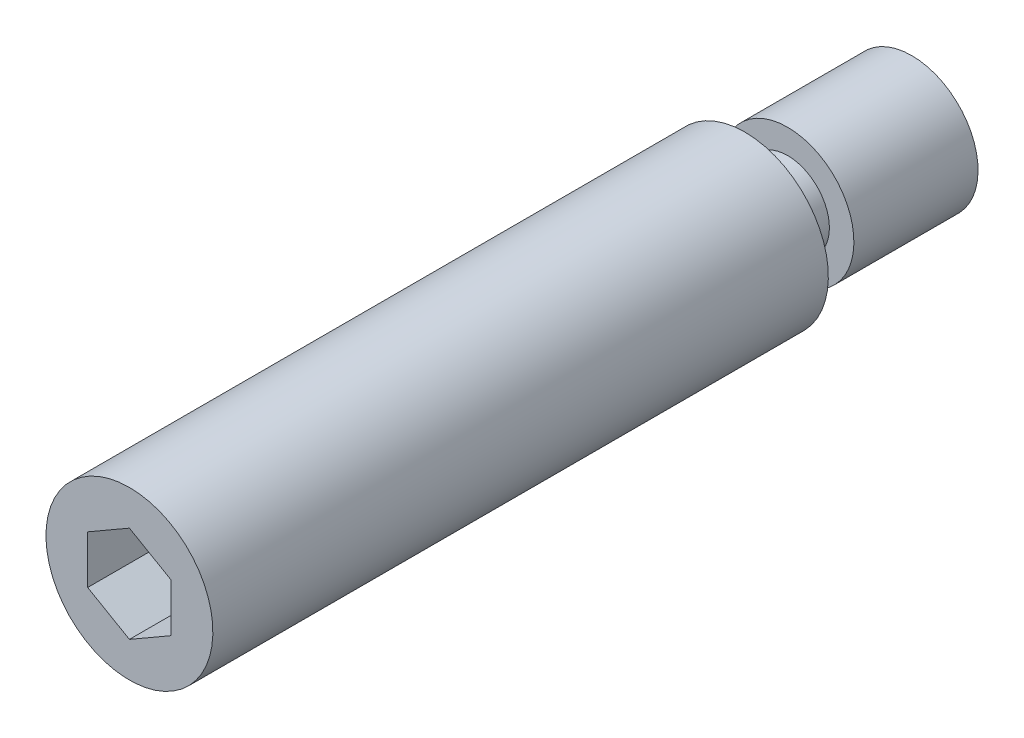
ISO-10303-21;
HEADER;
FILE_DESCRIPTION(('STEP AP214'),'2;1');
FILE_NAME('part.step','',(''),(''),'','','');
FILE_SCHEMA(('AUTOMOTIVE_DESIGN { 1 0 10303 214 1 1 1 1 }'));
ENDSEC;
DATA;
#1=APPLICATION_CONTEXT('core data for automotive mechanical design processes');
#2=APPLICATION_PROTOCOL_DEFINITION('international standard','automotive_design',2000,#1);
#3=PRODUCT_CONTEXT('',#1,'mechanical');
#4=PRODUCT('Part','Part','',(#3));
#5=PRODUCT_RELATED_PRODUCT_CATEGORY('part','',(#4));
#6=PRODUCT_DEFINITION_FORMATION('','',#4);
#7=PRODUCT_DEFINITION_CONTEXT('part definition',#1,'design');
#8=PRODUCT_DEFINITION('design','',#6,#7);
#9=PRODUCT_DEFINITION_SHAPE('','',#8);
#10=(LENGTH_UNIT() NAMED_UNIT(*) SI_UNIT(.MILLI.,.METRE.));
#11=(NAMED_UNIT(*) PLANE_ANGLE_UNIT() SI_UNIT($,.RADIAN.));
#12=(NAMED_UNIT(*) SI_UNIT($,.STERADIAN.) SOLID_ANGLE_UNIT());
#13=UNCERTAINTY_MEASURE_WITH_UNIT(LENGTH_MEASURE(1.E-05),#10,'distance_accuracy_value','');
#14=(GEOMETRIC_REPRESENTATION_CONTEXT(3) GLOBAL_UNCERTAINTY_ASSIGNED_CONTEXT((#13)) GLOBAL_UNIT_ASSIGNED_CONTEXT((#10,
#11,#12)) REPRESENTATION_CONTEXT('',''));
#15=CARTESIAN_POINT('',(0.,0.,0.));
#16=DIRECTION('',(0.,0.,1.));
#17=DIRECTION('',(1.,0.,0.));
#18=AXIS2_PLACEMENT_3D('',#15,#16,#17);
#19=CARTESIAN_POINT('',(0.,-8.,16.));
#20=DIRECTION('',(0.,0.,-1.));
#21=DIRECTION('',(0.,-1.,0.));
#22=AXIS2_PLACEMENT_3D('',#19,#20,#21);
#23=PLANE('',#22);
#24=CARTESIAN_POINT('',(0.,0.,16.));
#25=DIRECTION('',(0.,0.,1.));
#26=DIRECTION('',(0.,1.,0.));
#27=AXIS2_PLACEMENT_3D('',#24,#25,#26);
#28=CIRCLE('',#27,4.);
#29=CARTESIAN_POINT('',(0.,4.,16.));
#30=VERTEX_POINT('',#29);
#31=EDGE_CURVE('E115',#30,#30,#28,.T.);
#32=ORIENTED_EDGE('',*,*,#31,.T.);
#33=EDGE_LOOP('',(#32));
#34=FACE_BOUND('',#33,.T.);
#35=CARTESIAN_POINT('',(0.,0.,16.));
#36=DIRECTION('',(0.,0.,1.));
#37=DIRECTION('',(0.,1.,0.));
#38=AXIS2_PLACEMENT_3D('',#35,#36,#37);
#39=CIRCLE('',#38,8.);
#40=CARTESIAN_POINT('',(0.,8.,16.));
#41=VERTEX_POINT('',#40);
#42=EDGE_CURVE('E9',#41,#41,#39,.T.);
#43=ORIENTED_EDGE('',*,*,#42,.F.);
#44=EDGE_LOOP('',(#43));
#45=FACE_BOUND('',#44,.T.);
#46=ADVANCED_FACE('F14',(#34,#45),#23,.T.);
#47=CARTESIAN_POINT('',(0.,0.,20.));
#48=DIRECTION('',(0.,0.,1.));
#49=DIRECTION('',(0.,1.,0.));
#50=AXIS2_PLACEMENT_3D('',#47,#48,#49);
#51=CYLINDRICAL_SURFACE('',#50,8.);
#52=CARTESIAN_POINT('',(0.,0.,75.));
#53=DIRECTION('',(0.,0.,1.));
#54=DIRECTION('',(0.,1.,0.));
#55=AXIS2_PLACEMENT_3D('',#52,#53,#54);
#56=CIRCLE('',#55,8.);
#57=CARTESIAN_POINT('',(0.,8.,75.));
#58=VERTEX_POINT('',#57);
#59=EDGE_CURVE('E21',#58,#58,#56,.T.);
#60=ORIENTED_EDGE('',*,*,#59,.F.);
#61=EDGE_LOOP('',(#60));
#62=FACE_BOUND('',#61,.T.);
#63=ORIENTED_EDGE('',*,*,#42,.T.);
#64=EDGE_LOOP('',(#63));
#65=FACE_BOUND('',#64,.T.);
#66=ADVANCED_FACE('F136',(#62,#65),#51,.T.);
#67=CARTESIAN_POINT('',(0.,-8.,75.));
#68=DIRECTION('',(0.,0.,-1.));
#69=DIRECTION('',(0.,-1.,0.));
#70=AXIS2_PLACEMENT_3D('',#67,#68,#69);
#71=PLANE('',#70);
#72=DIRECTION('',(-0.866025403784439,-0.5,0.));
#73=VECTOR('',#72,1.);
#74=CARTESIAN_POINT('',(0.,4.61880215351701,75.));
#75=LINE('',#74,#73);
#76=CARTESIAN_POINT('',(0.,4.61880215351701,75.));
#77=VERTEX_POINT('',#76);
#78=CARTESIAN_POINT('',(-4.,2.30940107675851,75.));
#79=VERTEX_POINT('',#78);
#80=EDGE_CURVE('E102',#77,#79,#75,.T.);
#81=ORIENTED_EDGE('',*,*,#80,.F.);
#82=DIRECTION('',(-0.866025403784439,0.5,0.));
#83=VECTOR('',#82,1.);
#84=CARTESIAN_POINT('',(4.,2.30940107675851,75.));
#85=LINE('',#84,#83);
#86=CARTESIAN_POINT('',(4.,2.30940107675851,75.));
#87=VERTEX_POINT('',#86);
#88=EDGE_CURVE('E28',#87,#77,#85,.T.);
#89=ORIENTED_EDGE('',*,*,#88,.F.);
#90=DIRECTION('',(0.,1.,0.));
#91=VECTOR('',#90,1.);
#92=CARTESIAN_POINT('',(4.,-2.30940107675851,75.));
#93=LINE('',#92,#91);
#94=CARTESIAN_POINT('',(4.,-2.30940107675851,75.));
#95=VERTEX_POINT('',#94);
#96=EDGE_CURVE('E111',#95,#87,#93,.T.);
#97=ORIENTED_EDGE('',*,*,#96,.F.);
#98=DIRECTION('',(0.866025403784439,0.5,0.));
#99=VECTOR('',#98,1.);
#100=CARTESIAN_POINT('',(0.,-4.61880215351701,75.));
#101=LINE('',#100,#99);
#102=CARTESIAN_POINT('',(0.,-4.61880215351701,75.));
#103=VERTEX_POINT('',#102);
#104=EDGE_CURVE('E109',#103,#95,#101,.T.);
#105=ORIENTED_EDGE('',*,*,#104,.F.);
#106=DIRECTION('',(0.866025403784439,-0.5,0.));
#107=VECTOR('',#106,1.);
#108=CARTESIAN_POINT('',(-4.,-2.30940107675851,75.));
#109=LINE('',#108,#107);
#110=CARTESIAN_POINT('',(-4.,-2.30940107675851,75.));
#111=VERTEX_POINT('',#110);
#112=EDGE_CURVE('E76',#111,#103,#109,.T.);
#113=ORIENTED_EDGE('',*,*,#112,.F.);
#114=DIRECTION('',(0.,-1.,0.));
#115=VECTOR('',#114,1.);
#116=CARTESIAN_POINT('',(-4.,2.30940107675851,75.));
#117=LINE('',#116,#115);
#118=EDGE_CURVE('E105',#79,#111,#117,.T.);
#119=ORIENTED_EDGE('',*,*,#118,.F.);
#120=EDGE_LOOP('',(#81,#89,#97,#105,#113,#119));
#121=FACE_BOUND('',#120,.T.);
#122=ORIENTED_EDGE('',*,*,#59,.T.);
#123=EDGE_LOOP('',(#122));
#124=FACE_BOUND('',#123,.T.);
#125=ADVANCED_FACE('F134',(#121,#124),#71,.F.);
#126=CARTESIAN_POINT('',(0.,-6.35,0.));
#127=DIRECTION('',(0.,0.,-1.));
#128=DIRECTION('',(0.,-1.,0.));
#129=AXIS2_PLACEMENT_3D('',#126,#127,#128);
#130=PLANE('',#129);
#131=CARTESIAN_POINT('',(0.,0.,0.));
#132=DIRECTION('',(0.,0.,1.));
#133=DIRECTION('',(0.,1.,0.));
#134=AXIS2_PLACEMENT_3D('',#131,#132,#133);
#135=CIRCLE('',#134,6.35);
#136=CARTESIAN_POINT('',(0.,6.35,0.));
#137=VERTEX_POINT('',#136);
#138=EDGE_CURVE('E129',#137,#137,#135,.T.);
#139=ORIENTED_EDGE('',*,*,#138,.F.);
#140=EDGE_LOOP('',(#139));
#141=FACE_BOUND('',#140,.T.);
#142=ADVANCED_FACE('F167',(#141),#130,.T.);
#143=CARTESIAN_POINT('',(0.,0.,20.));
#144=DIRECTION('',(0.,0.,1.));
#145=DIRECTION('',(0.,1.,0.));
#146=AXIS2_PLACEMENT_3D('',#143,#144,#145);
#147=CYLINDRICAL_SURFACE('',#146,6.35);
#148=ORIENTED_EDGE('',*,*,#138,.T.);
#149=EDGE_LOOP('',(#148));
#150=FACE_BOUND('',#149,.T.);
#151=CARTESIAN_POINT('',(0.,0.,11.9));
#152=DIRECTION('',(0.,0.,1.));
#153=DIRECTION('',(0.,1.,0.));
#154=AXIS2_PLACEMENT_3D('',#151,#152,#153);
#155=CIRCLE('',#154,6.35);
#156=CARTESIAN_POINT('',(0.,6.35,11.9));
#157=VERTEX_POINT('',#156);
#158=EDGE_CURVE('E126',#157,#157,#155,.T.);
#159=ORIENTED_EDGE('',*,*,#158,.F.);
#160=EDGE_LOOP('',(#159));
#161=FACE_BOUND('',#160,.T.);
#162=ADVANCED_FACE('F160',(#150,#161),#147,.T.);
#163=CARTESIAN_POINT('',(0.,-4.,11.9));
#164=DIRECTION('',(0.,0.,1.));
#165=DIRECTION('',(0.,1.,0.));
#166=AXIS2_PLACEMENT_3D('',#163,#164,#165);
#167=PLANE('',#166);
#168=ORIENTED_EDGE('',*,*,#158,.T.);
#169=EDGE_LOOP('',(#168));
#170=FACE_BOUND('',#169,.T.);
#171=CARTESIAN_POINT('',(0.,0.,11.9));
#172=DIRECTION('',(0.,0.,1.));
#173=DIRECTION('',(0.,1.,0.));
#174=AXIS2_PLACEMENT_3D('',#171,#172,#173);
#175=CIRCLE('',#174,4.);
#176=CARTESIAN_POINT('',(0.,4.,11.9));
#177=VERTEX_POINT('',#176);
#178=EDGE_CURVE('E123',#177,#177,#175,.T.);
#179=ORIENTED_EDGE('',*,*,#178,.F.);
#180=EDGE_LOOP('',(#179));
#181=FACE_BOUND('',#180,.T.);
#182=ADVANCED_FACE('F151',(#170,#181),#167,.T.);
#183=CARTESIAN_POINT('',(0.,0.,20.));
#184=DIRECTION('',(0.,0.,1.));
#185=DIRECTION('',(0.,1.,0.));
#186=AXIS2_PLACEMENT_3D('',#183,#184,#185);
#187=CYLINDRICAL_SURFACE('',#186,4.);
#188=ORIENTED_EDGE('',*,*,#178,.T.);
#189=EDGE_LOOP('',(#188));
#190=FACE_BOUND('',#189,.T.);
#191=ORIENTED_EDGE('',*,*,#31,.F.);
#192=EDGE_LOOP('',(#191));
#193=FACE_BOUND('',#192,.T.);
#194=ADVANCED_FACE('F148',(#190,#193),#187,.T.);
#195=CARTESIAN_POINT('',(4.,2.30940107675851,65.));
#196=DIRECTION('',(0.5,0.866025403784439,0.));
#197=DIRECTION('',(-0.866025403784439,0.5,0.));
#198=AXIS2_PLACEMENT_3D('',#195,#196,#197);
#199=PLANE('',#198);
#200=ORIENTED_EDGE('',*,*,#88,.T.);
#201=DIRECTION('',(0.,0.,1.));
#202=VECTOR('',#201,1.);
#203=CARTESIAN_POINT('',(0.,4.61880215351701,65.));
#204=LINE('',#203,#202);
#205=CARTESIAN_POINT('',(0.,4.61880215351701,65.));
#206=VERTEX_POINT('',#205);
#207=EDGE_CURVE('E58',#206,#77,#204,.T.);
#208=ORIENTED_EDGE('',*,*,#207,.F.);
#209=DIRECTION('',(-0.866025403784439,0.5,0.));
#210=VECTOR('',#209,1.);
#211=CARTESIAN_POINT('',(4.,2.30940107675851,65.));
#212=LINE('',#211,#210);
#213=CARTESIAN_POINT('',(4.,2.30940107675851,65.));
#214=VERTEX_POINT('',#213);
#215=EDGE_CURVE('E113',#214,#206,#212,.T.);
#216=ORIENTED_EDGE('',*,*,#215,.F.);
#217=DIRECTION('',(0.,0.,1.));
#218=VECTOR('',#217,1.);
#219=CARTESIAN_POINT('',(4.,2.30940107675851,65.));
#220=LINE('',#219,#218);
#221=EDGE_CURVE('E36',#214,#87,#220,.T.);
#222=ORIENTED_EDGE('',*,*,#221,.T.);
#223=EDGE_LOOP('',(#200,#208,#216,#222));
#224=FACE_BOUND('',#223,.T.);
#225=ADVANCED_FACE('F150',(#224),#199,.F.);
#226=CARTESIAN_POINT('',(4.,-2.30940107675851,65.));
#227=DIRECTION('',(1.,0.,0.));
#228=DIRECTION('',(0.,0.,-1.));
#229=AXIS2_PLACEMENT_3D('',#226,#227,#228);
#230=PLANE('',#229);
#231=ORIENTED_EDGE('',*,*,#96,.T.);
#232=ORIENTED_EDGE('',*,*,#221,.F.);
#233=DIRECTION('',(0.,1.,0.));
#234=VECTOR('',#233,1.);
#235=CARTESIAN_POINT('',(4.,-2.30940107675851,65.));
#236=LINE('',#235,#234);
#237=CARTESIAN_POINT('',(4.,-2.30940107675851,65.));
#238=VERTEX_POINT('',#237);
#239=EDGE_CURVE('E88',#238,#214,#236,.T.);
#240=ORIENTED_EDGE('',*,*,#239,.F.);
#241=DIRECTION('',(0.,0.,1.));
#242=VECTOR('',#241,1.);
#243=CARTESIAN_POINT('',(4.,-2.30940107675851,65.));
#244=LINE('',#243,#242);
#245=EDGE_CURVE('E80',#238,#95,#244,.T.);
#246=ORIENTED_EDGE('',*,*,#245,.T.);
#247=EDGE_LOOP('',(#231,#232,#240,#246));
#248=FACE_BOUND('',#247,.T.);
#249=ADVANCED_FACE('F158',(#248),#230,.F.);
#250=CARTESIAN_POINT('',(0.,-4.61880215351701,65.));
#251=DIRECTION('',(0.5,-0.866025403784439,0.));
#252=DIRECTION('',(0.866025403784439,0.5,0.));
#253=AXIS2_PLACEMENT_3D('',#250,#251,#252);
#254=PLANE('',#253);
#255=ORIENTED_EDGE('',*,*,#104,.T.);
#256=ORIENTED_EDGE('',*,*,#245,.F.);
#257=DIRECTION('',(0.866025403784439,0.5,0.));
#258=VECTOR('',#257,1.);
#259=CARTESIAN_POINT('',(0.,-4.61880215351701,65.));
#260=LINE('',#259,#258);
#261=CARTESIAN_POINT('',(0.,-4.61880215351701,65.));
#262=VERTEX_POINT('',#261);
#263=EDGE_CURVE('E84',#262,#238,#260,.T.);
#264=ORIENTED_EDGE('',*,*,#263,.F.);
#265=DIRECTION('',(0.,0.,1.));
#266=VECTOR('',#265,1.);
#267=CARTESIAN_POINT('',(0.,-4.61880215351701,65.));
#268=LINE('',#267,#266);
#269=EDGE_CURVE('E69',#262,#103,#268,.T.);
#270=ORIENTED_EDGE('',*,*,#269,.T.);
#271=EDGE_LOOP('',(#255,#256,#264,#270));
#272=FACE_BOUND('',#271,.T.);
#273=ADVANCED_FACE('F85',(#272),#254,.F.);
#274=CARTESIAN_POINT('',(-4.,-2.30940107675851,65.));
#275=DIRECTION('',(-0.5,-0.866025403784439,0.));
#276=DIRECTION('',(0.866025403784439,-0.5,0.));
#277=AXIS2_PLACEMENT_3D('',#274,#275,#276);
#278=PLANE('',#277);
#279=ORIENTED_EDGE('',*,*,#112,.T.);
#280=ORIENTED_EDGE('',*,*,#269,.F.);
#281=DIRECTION('',(0.866025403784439,-0.5,0.));
#282=VECTOR('',#281,1.);
#283=CARTESIAN_POINT('',(-4.,-2.30940107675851,65.));
#284=LINE('',#283,#282);
#285=CARTESIAN_POINT('',(-4.,-2.30940107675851,65.));
#286=VERTEX_POINT('',#285);
#287=EDGE_CURVE('E73',#286,#262,#284,.T.);
#288=ORIENTED_EDGE('',*,*,#287,.F.);
#289=DIRECTION('',(0.,0.,1.));
#290=VECTOR('',#289,1.);
#291=CARTESIAN_POINT('',(-4.,-2.30940107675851,65.));
#292=LINE('',#291,#290);
#293=EDGE_CURVE('E81',#286,#111,#292,.T.);
#294=ORIENTED_EDGE('',*,*,#293,.T.);
#295=EDGE_LOOP('',(#279,#280,#288,#294));
#296=FACE_BOUND('',#295,.T.);
#297=ADVANCED_FACE('F71',(#296),#278,.F.);
#298=CARTESIAN_POINT('',(-4.,2.30940107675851,65.));
#299=DIRECTION('',(-1.,0.,0.));
#300=DIRECTION('',(0.,-1.,0.));
#301=AXIS2_PLACEMENT_3D('',#298,#299,#300);
#302=PLANE('',#301);
#303=ORIENTED_EDGE('',*,*,#118,.T.);
#304=ORIENTED_EDGE('',*,*,#293,.F.);
#305=DIRECTION('',(0.,-1.,0.));
#306=VECTOR('',#305,1.);
#307=CARTESIAN_POINT('',(-4.,2.30940107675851,65.));
#308=LINE('',#307,#306);
#309=CARTESIAN_POINT('',(-4.,2.30940107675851,65.));
#310=VERTEX_POINT('',#309);
#311=EDGE_CURVE('E94',#310,#286,#308,.T.);
#312=ORIENTED_EDGE('',*,*,#311,.F.);
#313=DIRECTION('',(0.,0.,1.));
#314=VECTOR('',#313,1.);
#315=CARTESIAN_POINT('',(-4.,2.30940107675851,65.));
#316=LINE('',#315,#314);
#317=EDGE_CURVE('E118',#310,#79,#316,.T.);
#318=ORIENTED_EDGE('',*,*,#317,.T.);
#319=EDGE_LOOP('',(#303,#304,#312,#318));
#320=FACE_BOUND('',#319,.T.);
#321=ADVANCED_FACE('F192',(#320),#302,.F.);
#322=CARTESIAN_POINT('',(0.,4.61880215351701,65.));
#323=DIRECTION('',(-0.5,0.866025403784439,0.));
#324=DIRECTION('',(-0.866025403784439,-0.5,0.));
#325=AXIS2_PLACEMENT_3D('',#322,#323,#324);
#326=PLANE('',#325);
#327=ORIENTED_EDGE('',*,*,#80,.T.);
#328=ORIENTED_EDGE('',*,*,#317,.F.);
#329=DIRECTION('',(-0.866025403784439,-0.5,0.));
#330=VECTOR('',#329,1.);
#331=CARTESIAN_POINT('',(0.,4.61880215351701,65.));
#332=LINE('',#331,#330);
#333=EDGE_CURVE('E96',#206,#310,#332,.T.);
#334=ORIENTED_EDGE('',*,*,#333,.F.);
#335=ORIENTED_EDGE('',*,*,#207,.T.);
#336=EDGE_LOOP('',(#327,#328,#334,#335));
#337=FACE_BOUND('',#336,.T.);
#338=ADVANCED_FACE('F180',(#337),#326,.F.);
#339=CARTESIAN_POINT('',(0.,4.61880215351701,65.));
#340=DIRECTION('',(0.,0.,1.));
#341=DIRECTION('',(1.,0.,0.));
#342=AXIS2_PLACEMENT_3D('',#339,#340,#341);
#343=PLANE('',#342);
#344=ORIENTED_EDGE('',*,*,#215,.T.);
#345=ORIENTED_EDGE('',*,*,#333,.T.);
#346=ORIENTED_EDGE('',*,*,#311,.T.);
#347=ORIENTED_EDGE('',*,*,#287,.T.);
#348=ORIENTED_EDGE('',*,*,#263,.T.);
#349=ORIENTED_EDGE('',*,*,#239,.T.);
#350=EDGE_LOOP('',(#344,#345,#346,#347,#348,#349));
#351=FACE_BOUND('',#350,.T.);
#352=ADVANCED_FACE('F91',(#351),#343,.T.);
#353=CLOSED_SHELL('',(#46,#66,#125,#142,#162,#182,#194,#225,#249,#273,#297,#321,#338,#352));
#354=MANIFOLD_SOLID_BREP('B1',#353);
#355=ADVANCED_BREP_SHAPE_REPRESENTATION('',(#18,#354),#14);
#356=SHAPE_DEFINITION_REPRESENTATION(#9,#355);
ENDSEC;
END-ISO-10303-21;
